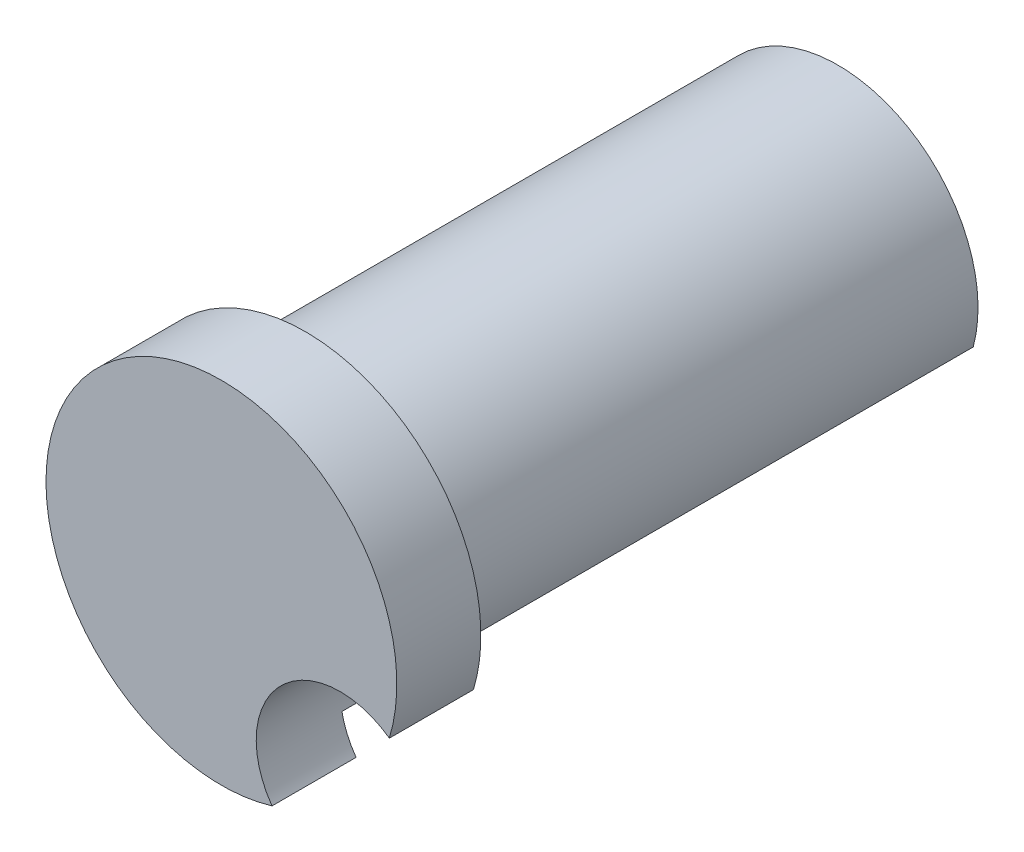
from build123d import *

# Parameters (mm, degrees)
SKETCH3_R          = 4.7625
CUT_EXTRUDE1_DEPTH = 38.646559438


with BuildPart() as part:
    # Sketch2 → Revolve1 (revolve)
    with BuildSketch(Plane(origin=(0, 0, 0), x_dir=(1, 0, 0), z_dir=(0, 1, 0))):
        Polygon((0, 0), (0, -34.925), (9.9375, -34.925), (9.9375, -30.1625), (7.9375, -30.1625), (7.9375, 0), align=None)
    revolve(axis=Axis((0, 0, 34.925), (0, 0, -1)))

    # Sketch3 → Cut-Extrude1 (cut, through all)
    with BuildSketch(Plane(origin=(0, 0, 0), x_dir=(-1, 0, 0), z_dir=(0, 0, -1))):
        with Locations((-6.735192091, -6.735192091)):
            Circle(SKETCH3_R)
    extrude(amount=-CUT_EXTRUDE1_DEPTH, mode=Mode.SUBTRACT)


solid = part.part
